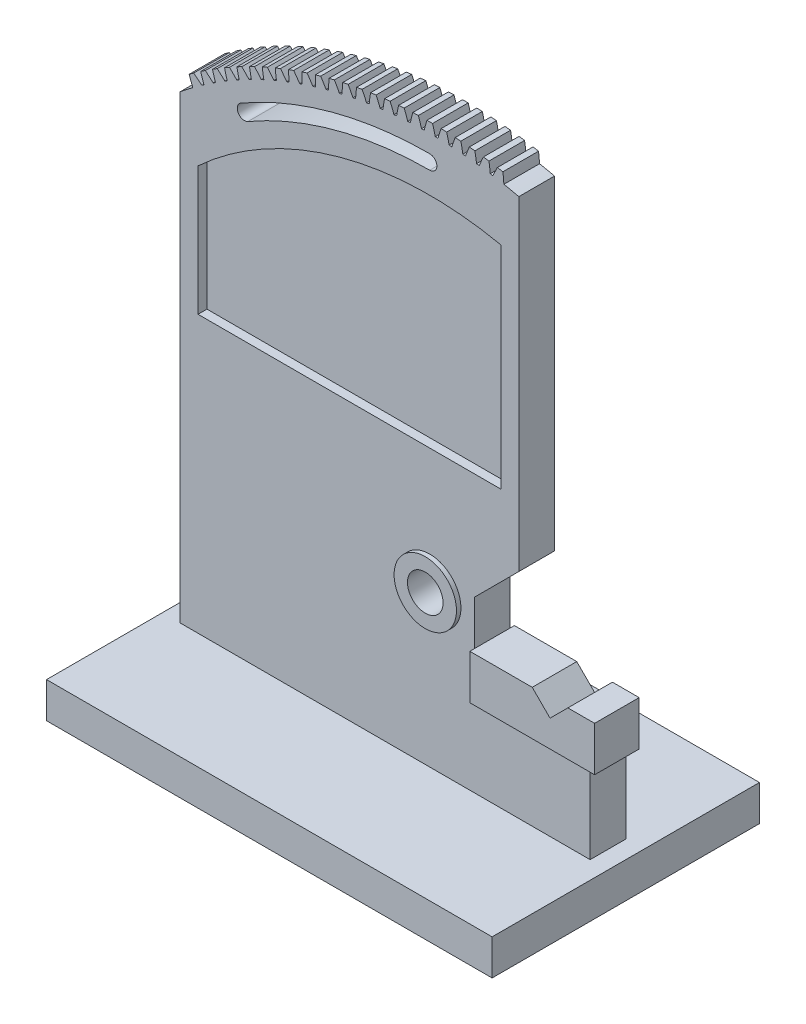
from build123d import *

# Parameters (mm, degrees)
SKETCH1_W           = 250
SKETCH1_H           = 20
BOSS_EXTRUDE1_DEPTH = 75
BOSS_EXTRUDE2_DEPTH = 10
SKETCH4_R           = 17.5
SKETCH4_R_2         = 10
BOSS_EXTRUDE3_DEPTH = 12.5
SKETCH5_R           = 10
CUT_EXTRUDE1_DEPTH  = 60
CUT_EXTRUDE2_DEPTH  = 5
BOSS_EXTRUDE4_DEPTH = 20
CIRPATTERN1_COUNT   = 6
CIRPATTERN1_ANGLE   = 10
CIRPATTERN2_COUNT   = 19
CIRPATTERN2_ANGLE   = 36


with BuildPart() as part:
    # Sketch1 → Boss-Extrude1 (new, symmetric)
    with BuildSketch(Plane.XY):
        Rectangle(SKETCH1_W, SKETCH1_H)
    extrude(amount=BOSS_EXTRUDE1_DEPTH, both=True)

    # Sketch2 → Boss-Extrude2 (add, symmetric)
    with BuildSketch(Plane.XY):
        with BuildLine():
            Line((75, 130), (75, 312.167795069))
            ThreePointArc((75, 312.167795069), (-25.098363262, 312.145019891), (-115, 268.129357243))
            Line((-115, 268.129357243), (-115, 10))
            Line((-115, 10), (0, 10))
            Line((0, 10), (115, 10))
            Line((115, 10), (115, 65))
            Line((115, 65), (50, 65))
            Line((50, 65), (50, 105))
            Line((50, 105), (75, 130))
        make_face()
        with BuildLine():
            ThreePointArc((-81, 279.597385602), (-82.464101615, 274.133283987), (-77, 272.669182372))
            ThreePointArc((-77, 272.669182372), (-27.799085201, 293.048868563), (25, 300))
            ThreePointArc((25, 300), (29, 304), (25, 308))
            ThreePointArc((25, 308), (-29.869637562, 300.776275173), (-81, 279.597385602))
        make_face(mode=Mode.SUBTRACT)
    extrude(amount=BOSS_EXTRUDE2_DEPTH, both=True)

    # Sketch4 → Boss-Extrude3 (add, symmetric)
    # profile 1 of 2: a face of its own
    with BuildSketch(Plane.XY):
        with Locations((25, 96)):
            Circle(SKETCH4_R)
        with Locations((25, 96)):
            Circle(SKETCH4_R_2, mode=Mode.SUBTRACT)
    # profile 2 of 2: a face of its own
    with BuildSketch(Plane.XY):
        Polygon((50, 55), (50, 80), (85, 80), (95, 70), (105, 80), (120, 80), (120, 55), align=None)
    extrude(amount=BOSS_EXTRUDE3_DEPTH, both=True)

    # Sketch5 → Cut-Extrude1 (cut, symmetric)
    with BuildSketch(Plane.XY.offset(10)):
        with Locations((25, 96)):
            Circle(SKETCH5_R)
    extrude(amount=CUT_EXTRUDE1_DEPTH, both=True, mode=Mode.SUBTRACT)

    # Sketch6 → Cut-Extrude2 (cut)
    with BuildSketch(Plane.XY.offset(10)):
        with BuildLine():
            Line((-105, 165), (-105, 237.124114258))
            ThreePointArc((-105, 237.124114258), (-25.659461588, 281.06656796), (65, 283.659307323))
            Line((65, 283.659307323), (65, 165))
            Line((65, 165), (-105, 165))
        make_face()
    cut_extrude2 = extrude(amount=-CUT_EXTRUDE2_DEPTH, mode=Mode.SUBTRACT)

    # Mirror1: Cut-Extrude2 across plane
    add(cut_extrude2.mirror(Plane.XY), mode=Mode.SUBTRACT)

    # Sketch7 → Boss-Extrude4 (add)
    with BuildSketch(Plane.XY.offset(10)):
        with BuildLine():
            ThreePointArc((26.563499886, 323.494627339), (25, 323.5), (23.436500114, 323.494627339))
            ThreePointArc((23.436500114, 323.494627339), (22.614893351, 320.686491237), (21.885, 317.8531325))
            ThreePointArc((21.885, 317.8531325), (25, 317.875), (28.115, 317.8531325))
            ThreePointArc((28.115, 317.8531325), (27.385106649, 320.686491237), (26.563499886, 323.494627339))
        make_face()
    boss_extrude4 = extrude(amount=-BOSS_EXTRUDE4_DEPTH)

    # CirPattern1: Boss-Extrude4 ×6 about axis
    cirpattern1_axis = Axis((25, 96, 0), (0, 0, -1))
    for i in range(1, CIRPATTERN1_COUNT):
        add(boss_extrude4.rotate(cirpattern1_axis, i * CIRPATTERN1_ANGLE / (CIRPATTERN1_COUNT - 1)))

    # CirPattern2: Boss-Extrude4 ×19 about axis
    cirpattern2_axis = Axis((25, 96, 0), (0, 0, 1))
    for i in range(1, CIRPATTERN2_COUNT):
        add(boss_extrude4.rotate(cirpattern2_axis, i * CIRPATTERN2_ANGLE / (CIRPATTERN2_COUNT - 1)))


solid = part.part
